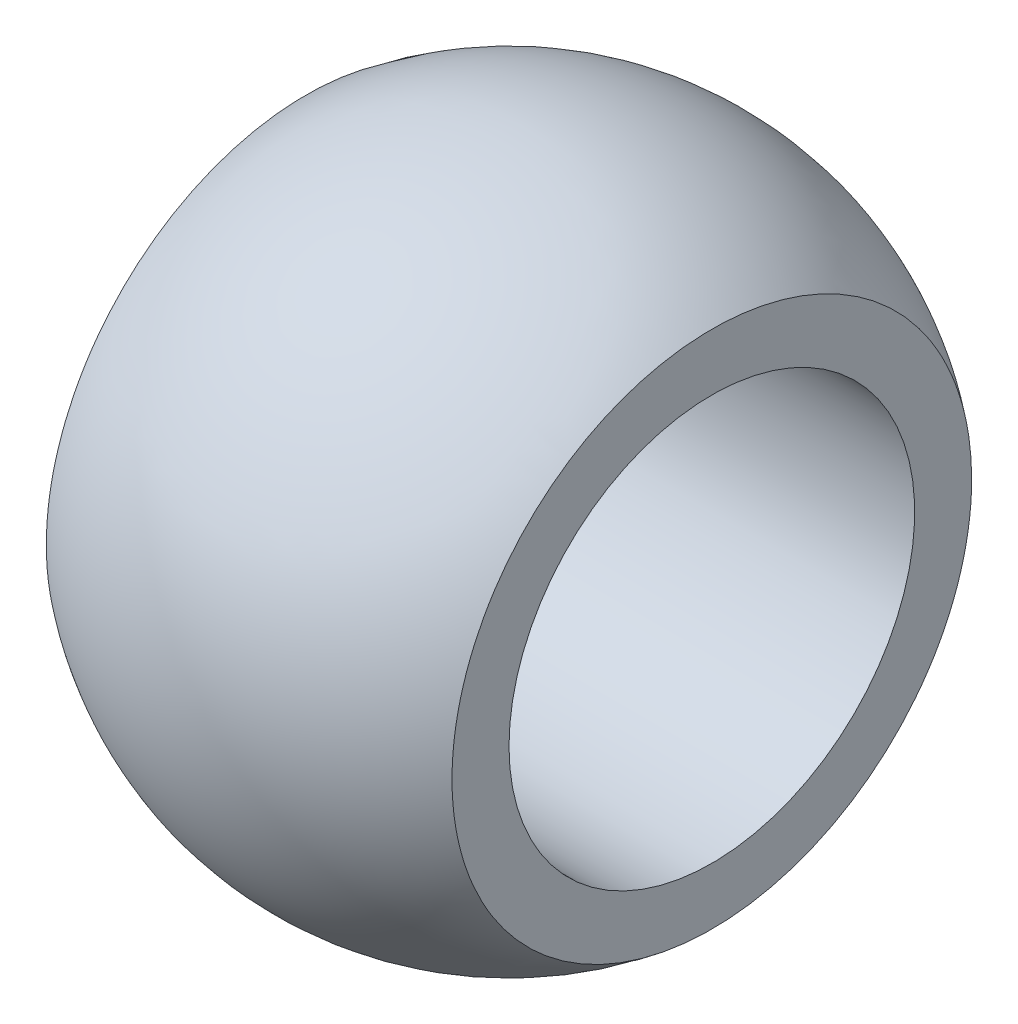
ISO-10303-21;
HEADER;
FILE_DESCRIPTION(('STEP AP214'),'2;1');
FILE_NAME('part.step','',(''),(''),'','','');
FILE_SCHEMA(('AUTOMOTIVE_DESIGN { 1 0 10303 214 1 1 1 1 }'));
ENDSEC;
DATA;
#1=APPLICATION_CONTEXT('core data for automotive mechanical design processes');
#2=APPLICATION_PROTOCOL_DEFINITION('international standard','automotive_design',2000,#1);
#3=PRODUCT_CONTEXT('',#1,'mechanical');
#4=PRODUCT('Part','Part','',(#3));
#5=PRODUCT_RELATED_PRODUCT_CATEGORY('part','',(#4));
#6=PRODUCT_DEFINITION_FORMATION('','',#4);
#7=PRODUCT_DEFINITION_CONTEXT('part definition',#1,'design');
#8=PRODUCT_DEFINITION('design','',#6,#7);
#9=PRODUCT_DEFINITION_SHAPE('','',#8);
#10=(LENGTH_UNIT() NAMED_UNIT(*) SI_UNIT(.MILLI.,.METRE.));
#11=(NAMED_UNIT(*) PLANE_ANGLE_UNIT() SI_UNIT($,.RADIAN.));
#12=(NAMED_UNIT(*) SI_UNIT($,.STERADIAN.) SOLID_ANGLE_UNIT());
#13=UNCERTAINTY_MEASURE_WITH_UNIT(LENGTH_MEASURE(1.E-05),#10,'distance_accuracy_value','');
#14=(GEOMETRIC_REPRESENTATION_CONTEXT(3) GLOBAL_UNCERTAINTY_ASSIGNED_CONTEXT((#13)) GLOBAL_UNIT_ASSIGNED_CONTEXT((#10,
#11,#12)) REPRESENTATION_CONTEXT('',''));
#15=CARTESIAN_POINT('',(0.,0.,0.));
#16=DIRECTION('',(0.,0.,1.));
#17=DIRECTION('',(1.,0.,0.));
#18=AXIS2_PLACEMENT_3D('',#15,#16,#17);
#19=CARTESIAN_POINT('',(-6.5,0.,0.));
#20=DIRECTION('',(-1.,0.,0.));
#21=DIRECTION('',(0.,0.,1.));
#22=AXIS2_PLACEMENT_3D('',#19,#20,#21);
#23=CYLINDRICAL_SURFACE('',#22,4.);
#24=CARTESIAN_POINT('',(-4.,0.,0.));
#25=DIRECTION('',(-1.,0.,0.));
#26=DIRECTION('',(0.,0.,1.));
#27=AXIS2_PLACEMENT_3D('',#24,#25,#26);
#28=CIRCLE('',#27,4.);
#29=CARTESIAN_POINT('',(-4.,0.,4.));
#30=VERTEX_POINT('',#29);
#31=EDGE_CURVE('E47',#30,#30,#28,.T.);
#32=ORIENTED_EDGE('',*,*,#31,.T.);
#33=EDGE_LOOP('',(#32));
#34=FACE_BOUND('',#33,.T.);
#35=CARTESIAN_POINT('',(4.,0.,0.));
#36=DIRECTION('',(-1.,0.,0.));
#37=DIRECTION('',(0.,0.,1.));
#38=AXIS2_PLACEMENT_3D('',#35,#36,#37);
#39=CIRCLE('',#38,4.);
#40=CARTESIAN_POINT('',(4.,0.,4.));
#41=VERTEX_POINT('',#40);
#42=EDGE_CURVE('E19',#41,#41,#39,.F.);
#43=ORIENTED_EDGE('',*,*,#42,.T.);
#44=EDGE_LOOP('',(#43));
#45=FACE_BOUND('',#44,.T.);
#46=ADVANCED_FACE('F16',(#34,#45),#23,.F.);
#47=CARTESIAN_POINT('',(4.,-6.5,-6.5));
#48=DIRECTION('',(-1.,0.,0.));
#49=DIRECTION('',(0.,0.,1.));
#50=AXIS2_PLACEMENT_3D('',#47,#48,#49);
#51=PLANE('',#50);
#52=CARTESIAN_POINT('',(4.,9.74047231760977E-13,-5.1234753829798));
#53=CARTESIAN_POINT('',(4.,-0.143957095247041,-5.12347674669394));
#54=CARTESIAN_POINT('',(4.,-0.287892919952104,-5.11740592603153));
#55=CARTESIAN_POINT('',(4.,-0.574788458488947,-5.09316608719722));
#56=CARTESIAN_POINT('',(4.,-0.717747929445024,-5.07499416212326));
#57=CARTESIAN_POINT('',(4.,-1.00173999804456,-5.02665725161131));
#58=CARTESIAN_POINT('',(4.,-1.14277095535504,-4.99648264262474));
#59=CARTESIAN_POINT('',(4.,-1.42184001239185,-4.92434245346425));
#60=CARTESIAN_POINT('',(4.,-1.55987700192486,-4.88237257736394));
#61=CARTESIAN_POINT('',(4.,-1.83181144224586,-4.78698363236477));
#62=CARTESIAN_POINT('',(4.,-1.96571213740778,-4.73357381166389));
#63=CARTESIAN_POINT('',(4.,-2.22858717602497,-4.61564290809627));
#64=CARTESIAN_POINT('',(4.,-2.35755968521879,-4.5511177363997));
#65=CARTESIAN_POINT('',(4.,-2.60953342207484,-4.41147039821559));
#66=CARTESIAN_POINT('',(4.,-2.73253816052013,-4.33635456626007));
#67=CARTESIAN_POINT('',(4.,-2.97182883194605,-4.17600099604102));
#68=CARTESIAN_POINT('',(4.,-3.08811226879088,-4.09075953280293));
#69=CARTESIAN_POINT('',(4.,-3.31305352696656,-3.91080759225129));
#70=CARTESIAN_POINT('',(4.,-3.4217134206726,-3.81609970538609));
#71=CARTESIAN_POINT('',(4.,-3.6307088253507,-3.61783199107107));
#72=CARTESIAN_POINT('',(4.,-3.73104125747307,-3.51426891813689));
#73=CARTESIAN_POINT('',(4.,-3.92259263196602,-3.29909209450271));
#74=CARTESIAN_POINT('',(4.,-4.01381449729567,-3.1874809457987));
#75=CARTESIAN_POINT('',(4.,-4.18656321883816,-2.9569315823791));
#76=CARTESIAN_POINT('',(4.,-4.2680866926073,-2.83799083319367));
#77=CARTESIAN_POINT('',(4.,-4.42080742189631,-2.59368653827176));
#78=CARTESIAN_POINT('',(4.,-4.49200663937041,-2.46832421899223));
#79=CARTESIAN_POINT('',(4.,-4.62359116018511,-2.21204721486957));
#80=CARTESIAN_POINT('',(4.,-4.68397646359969,-2.08113253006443));
#81=CARTESIAN_POINT('',(4.,-4.79351321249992,-1.81465871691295));
#82=CARTESIAN_POINT('',(4.00000000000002,-4.84266273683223,-1.67909879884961));
#83=CARTESIAN_POINT('',(3.99999999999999,-4.92935008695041,-1.40436765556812));
#84=CARTESIAN_POINT('',(3.99999999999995,-4.96689194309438,-1.26519770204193));
#85=CARTESIAN_POINT('',(3.99999999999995,-5.03013168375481,-0.984139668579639));
#86=CARTESIAN_POINT('',(3.99999999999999,-5.05582530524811,-0.842250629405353));
#87=CARTESIAN_POINT('',(4.00000000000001,-5.09515868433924,-0.556864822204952));
#88=CARTESIAN_POINT('',(4.,-5.10880287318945,-0.41336866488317));
#89=CARTESIAN_POINT('',(4.,-5.12395932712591,-0.125683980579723));
#90=CARTESIAN_POINT('',(4.,-5.12546712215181,0.0185047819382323));
#91=CARTESIAN_POINT('',(4.,-5.11633001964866,0.306443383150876));
#92=CARTESIAN_POINT('',(3.99999999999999,-5.10568960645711,0.450193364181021));
#93=CARTESIAN_POINT('',(3.99999999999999,-5.07233289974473,0.7363385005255));
#94=CARTESIAN_POINT('',(4.,-5.04961221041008,0.87873314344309));
#95=CARTESIAN_POINT('',(4.,-4.99226444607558,1.16104949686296));
#96=CARTESIAN_POINT('',(4.,-4.95764176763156,1.30097210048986));
#97=CARTESIAN_POINT('',(4.,-4.87671885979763,1.57745647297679));
#98=CARTESIAN_POINT('',(4.,-4.83041420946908,1.71401694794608));
#99=CARTESIAN_POINT('',(4.,-4.72648255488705,1.98270108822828));
#100=CARTESIAN_POINT('',(3.99999999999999,-4.66885972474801,2.11482636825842));
#101=CARTESIAN_POINT('',(3.99999999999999,-4.54266834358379,2.37379821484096));
#102=CARTESIAN_POINT('',(4.,-4.47409610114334,2.50064298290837));
#103=CARTESIAN_POINT('',(4.,-4.3265273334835,2.74807373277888));
#104=CARTESIAN_POINT('',(4.,-4.24753322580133,2.86866115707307));
#105=CARTESIAN_POINT('',(4.,-4.07969787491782,3.10270570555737));
#106=CARTESIAN_POINT('',(4.,-3.99086110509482,3.21616603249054));
#107=CARTESIAN_POINT('',(4.,-3.80388990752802,3.43528920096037));
#108=CARTESIAN_POINT('',(3.99999999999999,-3.70574658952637,3.54094441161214));
#109=CARTESIAN_POINT('',(3.99999999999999,-3.39858184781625,3.84478855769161));
#110=CARTESIAN_POINT('',(4.,-3.17660276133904,4.03016616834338));
#111=CARTESIAN_POINT('',(4.,-2.7046460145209,4.36095490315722));
#112=CARTESIAN_POINT('',(4.,-2.45466942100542,4.5063675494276));
#113=CARTESIAN_POINT('',(4.,-2.06413743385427,4.69150567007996));
#114=CARTESIAN_POINT('',(4.,-1.93119804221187,4.74776881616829));
#115=CARTESIAN_POINT('',(4.,-1.66112384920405,4.84885681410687));
#116=CARTESIAN_POINT('',(4.,-1.52399254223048,4.89369091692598));
#117=CARTESIAN_POINT('',(4.,-1.24667135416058,4.97157246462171));
#118=CARTESIAN_POINT('',(4.,-1.10648667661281,5.00463851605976));
#119=CARTESIAN_POINT('',(4.,-0.823857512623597,5.05884851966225));
#120=CARTESIAN_POINT('',(4.,-0.681413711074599,5.07999601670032));
#121=CARTESIAN_POINT('',(4.,-0.44895766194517,5.10455918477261));
#122=CARTESIAN_POINT('',(4.,-0.359317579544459,5.11165052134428));
#123=CARTESIAN_POINT('',(4.,-0.179788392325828,5.12110886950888));
#124=CARTESIAN_POINT('',(4.,-0.089899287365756,5.12347587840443));
#125=CARTESIAN_POINT('',(4.,0.143836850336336,5.12347459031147));
#126=CARTESIAN_POINT('',(4.,0.287699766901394,5.11741315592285));
#127=CARTESIAN_POINT('',(4.,0.574461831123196,5.09320276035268));
#128=CARTESIAN_POINT('',(4.,0.717360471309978,5.07504787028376));
#129=CARTESIAN_POINT('',(4.,1.00137003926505,5.02673244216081));
#130=CARTESIAN_POINT('',(4.,1.14247748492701,4.99655138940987));
#131=CARTESIAN_POINT('',(4.,1.42169473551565,4.92438711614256));
#132=CARTESIAN_POINT('',(4.,1.55980339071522,4.88239945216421));
#133=CARTESIAN_POINT('',(4.,1.83183230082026,4.78697526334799));
#134=CARTESIAN_POINT('',(4.,1.96575735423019,4.73355245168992));
#135=CARTESIAN_POINT('',(4.,2.22865158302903,4.61561508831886));
#136=CARTESIAN_POINT('',(4.,2.35761888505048,4.55109639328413));
#137=CARTESIAN_POINT('',(4.,2.73543475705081,4.34167123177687));
#138=CARTESIAN_POINT('',(4.,2.97563320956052,4.18074226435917));
#139=CARTESIAN_POINT('',(4.,3.42558537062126,3.82078263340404));
#140=CARTESIAN_POINT('',(4.,3.63533608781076,3.62174823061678));
#141=CARTESIAN_POINT('',(4.,3.92259437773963,3.29910509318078));
#142=CARTESIAN_POINT('',(4.,4.01383957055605,3.18745637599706));
#143=CARTESIAN_POINT('',(4.,4.18659130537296,2.95688520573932));
#144=CARTESIAN_POINT('',(4.,4.2681014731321,2.83796548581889));
#145=CARTESIAN_POINT('',(4.,4.42086600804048,2.59359452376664));
#146=CARTESIAN_POINT('',(4.,4.49211242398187,2.46813831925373));
#147=CARTESIAN_POINT('',(4.,4.62375291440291,2.21171201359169));
#148=CARTESIAN_POINT('',(4.,4.68415093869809,2.0807439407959));
#149=CARTESIAN_POINT('',(4.,4.79365026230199,1.81428935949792));
#150=CARTESIAN_POINT('',(4.00000000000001,4.84276068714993,1.67880660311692));
#151=CARTESIAN_POINT('',(3.99999999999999,4.92938738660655,1.40423118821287));
#152=CARTESIAN_POINT('',(3.99999999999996,4.96690644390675,1.2651394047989));
#153=CARTESIAN_POINT('',(3.99999999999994,5.03998527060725,0.940339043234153));
#154=CARTESIAN_POINT('',(3.99999999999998,5.07126513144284,0.75365170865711));
#155=CARTESIAN_POINT('',(4.00000000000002,5.11300930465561,0.37796404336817));
#156=CARTESIAN_POINT('',(4.00000000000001,5.12347360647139,0.188963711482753));
#157=CARTESIAN_POINT('',(4.,5.12347673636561,-0.143956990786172));
#158=CARTESIAN_POINT('',(4.,5.1174059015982,-0.28789272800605));
#159=CARTESIAN_POINT('',(4.,5.09316617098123,-0.57478794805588));
#160=CARTESIAN_POINT('',(4.,5.07499436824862,-0.717747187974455));
#161=CARTESIAN_POINT('',(4.,5.02665724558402,-1.00173956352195));
#162=CARTESIAN_POINT('',(4.,4.99648228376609,-1.14277105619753));
#163=CARTESIAN_POINT('',(4.,4.92434300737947,-1.42183915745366));
#164=CARTESIAN_POINT('',(3.99999999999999,4.88237439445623,-1.55987465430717));
#165=CARTESIAN_POINT('',(3.99999999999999,4.78698114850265,-1.83181569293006));
#166=CARTESIAN_POINT('',(4.,4.73356560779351,-1.96572441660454));
#167=CARTESIAN_POINT('',(4.,4.61564551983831,-2.22858736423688));
#168=CARTESIAN_POINT('',(4.,4.55113683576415,-2.35753971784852));
#169=CARTESIAN_POINT('',(4.,4.34171097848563,-2.73537541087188));
#170=CARTESIAN_POINT('',(3.99999999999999,4.18076446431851,-2.97560545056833));
#171=CARTESIAN_POINT('',(4.,3.82077807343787,-3.42559107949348));
#172=CARTESIAN_POINT('',(4.,3.62173819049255,-3.63534666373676));
#173=CARTESIAN_POINT('',(4.,3.29909115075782,-3.92260596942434));
#174=CARTESIAN_POINT('',(4.,3.18744495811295,-4.01384850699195));
#175=CARTESIAN_POINT('',(4.,2.95687922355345,-4.18659540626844));
#176=CARTESIAN_POINT('',(4.,2.83796241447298,-4.26810339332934));
#177=CARTESIAN_POINT('',(4.,2.59359501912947,-4.42086569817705));
#178=CARTESIAN_POINT('',(4.,2.46813933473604,-4.49211184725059));
#179=CARTESIAN_POINT('',(4.,2.21171410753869,-4.62375189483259));
#180=CARTESIAN_POINT('',(4.,2.08074659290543,-4.68414974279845));
#181=CARTESIAN_POINT('',(4.,1.81429208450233,-4.79364924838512));
#182=CARTESIAN_POINT('',(4.,1.67880880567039,-4.84275994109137));
#183=CARTESIAN_POINT('',(4.,1.40423231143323,-4.92938708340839));
#184=CARTESIAN_POINT('',(4.,1.26513997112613,-4.96690631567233));
#185=CARTESIAN_POINT('',(4.,0.940338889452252,-5.03998530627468));
#186=CARTESIAN_POINT('',(4.,0.753651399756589,-5.07126518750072));
#187=CARTESIAN_POINT('',(4.,0.377963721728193,-5.11300931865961));
#188=CARTESIAN_POINT('',(4.,0.188963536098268,-5.12347359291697));
#189=CARTESIAN_POINT('',(4.,9.74047231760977E-13,-5.1234753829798));
#190=B_SPLINE_CURVE_WITH_KNOTS('',3,(#52,#53,#54,#55,#56,#57,#58,#59,#60,#61,#62,#63,#64,#65,
#66,#67,#68,#69,#70,#71,#72,#73,#74,#75,#76,#77,#78,#79,#80,#81,#82,#83,#84,#85,#86,#87,#88,#89,
#90,#91,#92,#93,#94,#95,#96,#97,#98,#99,#100,#101,#102,#103,#104,#105,#106,#107,#108,#109,#110,
#111,#112,#113,#114,#115,#116,#117,#118,#119,#120,#121,#122,#123,#124,#125,#126,#127,#128,#129,
#130,#131,#132,#133,#134,#135,#136,#137,#138,#139,#140,#141,#142,#143,#144,#145,#146,#147,#148,
#149,#150,#151,#152,#153,#154,#155,#156,#157,#158,#159,#160,#161,#162,#163,#164,#165,#166,#167,
#168,#169,#170,#171,#172,#173,#174,#175,#176,#177,#178,#179,#180,#181,#182,#183,#184,#185,#186,
#187,#188,#189),.UNSPECIFIED.,.T.,.F.,(4,2,2,2,2,2,2,2,2,2,2,2,2,2,2,2,2,2,2,2,2,2,2,2,2,2,2,2,
2,2,2,2,2,2,2,2,2,2,2,2,2,2,2,2,2,2,2,2,2,2,2,2,2,2,2,2,2,2,2,2,2,2,2,2,2,2,2,2,4),(0.,
0.431706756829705,0.863517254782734,1.29567467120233,1.72798968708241,2.15995652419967,
2.59208260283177,3.02395130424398,3.45597937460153,3.88788954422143,4.31995869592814,
4.75188877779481,5.18396906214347,5.61596712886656,6.04796519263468,6.48003706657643,
6.9119587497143,7.34403571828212,7.77595372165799,8.20803080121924,8.63994843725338,
9.07202334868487,9.50393882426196,9.93601800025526,10.3679381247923,10.8000041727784,
11.2319701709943,11.6637406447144,12.0959278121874,12.9591709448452,13.82238119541,
14.2550174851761,14.6873024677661,15.1189008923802,15.5503708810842,15.8200171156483,
16.0896635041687,16.5210916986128,16.9527315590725,17.3851109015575,17.8176531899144,
18.2496796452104,18.6818677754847,19.5448753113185,20.4079675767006,20.8401131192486,
21.2720972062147,21.7044141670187,22.1365734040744,22.5683820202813,23.0000868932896,
23.5667617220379,24.1334368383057,24.565143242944,24.9969533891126,25.4291111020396,
25.8614265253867,26.2933998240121,26.7255345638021,27.5886483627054,28.4517623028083,
28.883896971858,29.3158701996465,29.7481854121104,30.1803429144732,30.6121532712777,
31.0438598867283,31.6105351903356,32.1772098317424),.UNSPECIFIED.);
#191=CARTESIAN_POINT('',(4.,9.74047231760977E-13,-5.1234753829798));
#192=VERTEX_POINT('',#191);
#193=EDGE_CURVE('E25',#192,#192,#190,.T.);
#194=ORIENTED_EDGE('',*,*,#193,.F.);
#195=EDGE_LOOP('',(#194));
#196=FACE_BOUND('',#195,.T.);
#197=ORIENTED_EDGE('',*,*,#42,.F.);
#198=EDGE_LOOP('',(#197));
#199=FACE_BOUND('',#198,.T.);
#200=ADVANCED_FACE('F43',(#196,#199),#51,.F.);
#201=CARTESIAN_POINT('',(-4.,6.5,-6.5));
#202=DIRECTION('',(1.,0.,0.));
#203=DIRECTION('',(0.,0.,-1.));
#204=AXIS2_PLACEMENT_3D('',#201,#202,#203);
#205=PLANE('',#204);
#206=CARTESIAN_POINT('',(-4.,-9.72312508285E-13,5.1234753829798));
#207=CARTESIAN_POINT('',(-4.,-0.14383685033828,5.12347459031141));
#208=CARTESIAN_POINT('',(-4.,-0.287699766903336,5.11741315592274));
#209=CARTESIAN_POINT('',(-4.,-0.574461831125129,5.09320276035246));
#210=CARTESIAN_POINT('',(-4.,-0.717360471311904,5.07504787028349));
#211=CARTESIAN_POINT('',(-4.,-1.00137003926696,5.02673244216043));
#212=CARTESIAN_POINT('',(-4.,-1.14247748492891,4.99655138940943));
#213=CARTESIAN_POINT('',(-4.,-1.42169473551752,4.92438711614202));
#214=CARTESIAN_POINT('',(-4.,-1.55980339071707,4.88239945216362));
#215=CARTESIAN_POINT('',(-4.,-1.83183230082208,4.7869752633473));
#216=CARTESIAN_POINT('',(-4.,-1.96575735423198,4.73355245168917));
#217=CARTESIAN_POINT('',(-4.,-2.22865158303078,4.61561508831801));
#218=CARTESIAN_POINT('',(-4.,-2.35761888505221,4.55109639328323));
#219=CARTESIAN_POINT('',(-4.,-2.73543475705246,4.34167123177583));
#220=CARTESIAN_POINT('',(-4.,-2.9756332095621,4.18074226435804));
#221=CARTESIAN_POINT('',(-4.,-3.42558537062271,3.82078263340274));
#222=CARTESIAN_POINT('',(-4.,-3.63533608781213,3.6217482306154));
#223=CARTESIAN_POINT('',(-4.,-3.92259437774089,3.29910509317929));
#224=CARTESIAN_POINT('',(-4.,-4.01383957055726,3.18745637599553));
#225=CARTESIAN_POINT('',(-4.,-4.18659130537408,2.95688520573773));
#226=CARTESIAN_POINT('',(-4.,-4.26810147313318,2.83796548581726));
#227=CARTESIAN_POINT('',(-4.,-4.42086600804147,2.59359452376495));
#228=CARTESIAN_POINT('',(-4.,-4.49211242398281,2.46813831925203));
#229=CARTESIAN_POINT('',(-4.,-4.62375291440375,2.21171201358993));
#230=CARTESIAN_POINT('',(-4.,-4.68415093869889,2.08074394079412));
#231=CARTESIAN_POINT('',(-4.,-4.79365026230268,1.81428935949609));
#232=CARTESIAN_POINT('',(-4.00000000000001,-4.84276068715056,1.67880660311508));
#233=CARTESIAN_POINT('',(-3.99999999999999,-4.92938738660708,1.40423118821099));
#234=CARTESIAN_POINT('',(-3.99999999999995,-4.96690644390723,1.26513940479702));
#235=CARTESIAN_POINT('',(-3.99999999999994,-5.03998527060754,0.940339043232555));
#236=CARTESIAN_POINT('',(-3.99999999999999,-5.07126513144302,0.753651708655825));
#237=CARTESIAN_POINT('',(-4.00000000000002,-5.11300930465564,0.377964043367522));
#238=CARTESIAN_POINT('',(-4.,-5.12347360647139,0.188963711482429));
#239=CARTESIAN_POINT('',(-4.,-5.12347673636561,-0.143956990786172));
#240=CARTESIAN_POINT('',(-4.,-5.1174059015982,-0.28789272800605));
#241=CARTESIAN_POINT('',(-4.,-5.09316617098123,-0.574787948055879));
#242=CARTESIAN_POINT('',(-4.,-5.07499436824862,-0.717747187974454));
#243=CARTESIAN_POINT('',(-4.,-5.02665724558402,-1.00173956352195));
#244=CARTESIAN_POINT('',(-4.,-4.99648228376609,-1.14277105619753));
#245=CARTESIAN_POINT('',(-4.,-4.92434300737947,-1.42183915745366));
#246=CARTESIAN_POINT('',(-3.99999999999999,-4.88237439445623,-1.55987465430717));
#247=CARTESIAN_POINT('',(-3.99999999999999,-4.78698114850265,-1.83181569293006));
#248=CARTESIAN_POINT('',(-4.,-4.73356560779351,-1.96572441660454));
#249=CARTESIAN_POINT('',(-4.,-4.61564551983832,-2.22858736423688));
#250=CARTESIAN_POINT('',(-4.,-4.55113683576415,-2.35753971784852));
#251=CARTESIAN_POINT('',(-4.,-4.34171097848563,-2.73537541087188));
#252=CARTESIAN_POINT('',(-4.,-4.1807644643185,-2.97560545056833));
#253=CARTESIAN_POINT('',(-4.,-3.82077807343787,-3.42559107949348));
#254=CARTESIAN_POINT('',(-4.,-3.62173819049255,-3.63534666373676));
#255=CARTESIAN_POINT('',(-4.,-3.29909115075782,-3.92260596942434));
#256=CARTESIAN_POINT('',(-4.,-3.18744495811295,-4.01384850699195));
#257=CARTESIAN_POINT('',(-4.,-2.95687922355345,-4.18659540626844));
#258=CARTESIAN_POINT('',(-4.,-2.83796241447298,-4.26810339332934));
#259=CARTESIAN_POINT('',(-4.,-2.59359501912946,-4.42086569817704));
#260=CARTESIAN_POINT('',(-4.,-2.46813933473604,-4.49211184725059));
#261=CARTESIAN_POINT('',(-4.,-2.21171410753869,-4.6237518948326));
#262=CARTESIAN_POINT('',(-4.,-2.08074659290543,-4.68414974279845));
#263=CARTESIAN_POINT('',(-4.,-1.81429208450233,-4.79364924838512));
#264=CARTESIAN_POINT('',(-4.,-1.67880880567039,-4.84275994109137));
#265=CARTESIAN_POINT('',(-4.,-1.40423231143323,-4.92938708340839));
#266=CARTESIAN_POINT('',(-4.,-1.26513997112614,-4.96690631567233));
#267=CARTESIAN_POINT('',(-4.,-0.940338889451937,-5.03998530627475));
#268=CARTESIAN_POINT('',(-4.,-0.753651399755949,-5.07126518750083));
#269=CARTESIAN_POINT('',(-4.,-0.3779637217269,-5.11300931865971));
#270=CARTESIAN_POINT('',(-4.,-0.188963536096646,-5.12347359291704));
#271=CARTESIAN_POINT('',(-4.,0.143957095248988,-5.12347674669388));
#272=CARTESIAN_POINT('',(-4.,0.287892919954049,-5.11740592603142));
#273=CARTESIAN_POINT('',(-4.,0.574788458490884,-5.093166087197));
#274=CARTESIAN_POINT('',(-4.,0.717747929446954,-5.07499416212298));
#275=CARTESIAN_POINT('',(-4.,1.00173999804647,-5.02665725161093));
#276=CARTESIAN_POINT('',(-4.,1.14277095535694,-4.9964826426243));
#277=CARTESIAN_POINT('',(-4.,1.42184001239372,-4.92434245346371));
#278=CARTESIAN_POINT('',(-4.,1.55987700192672,-4.88237257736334));
#279=CARTESIAN_POINT('',(-4.,1.83181144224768,-4.78698363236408));
#280=CARTESIAN_POINT('',(-4.,1.96571213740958,-4.73357381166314));
#281=CARTESIAN_POINT('',(-4.,2.22858717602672,-4.61564290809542));
#282=CARTESIAN_POINT('',(-4.,2.35755968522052,-4.5511177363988));
#283=CARTESIAN_POINT('',(-4.,2.60953342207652,-4.4114703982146));
#284=CARTESIAN_POINT('',(-4.,2.73253816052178,-4.33635456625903));
#285=CARTESIAN_POINT('',(-4.,2.97182883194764,-4.1760009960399));
#286=CARTESIAN_POINT('',(-4.,3.08811226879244,-4.09075953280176));
#287=CARTESIAN_POINT('',(-4.,3.31305352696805,-3.91080759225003));
#288=CARTESIAN_POINT('',(-4.,3.42171342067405,-3.81609970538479));
#289=CARTESIAN_POINT('',(-4.,3.63070882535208,-3.61783199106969));
#290=CARTESIAN_POINT('',(-4.,3.73104125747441,-3.51426891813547));
#291=CARTESIAN_POINT('',(-4.,3.92259263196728,-3.29909209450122));
#292=CARTESIAN_POINT('',(-4.,4.01381449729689,-3.18748094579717));
#293=CARTESIAN_POINT('',(-4.,4.18656321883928,-2.95693158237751));
#294=CARTESIAN_POINT('',(-4.,4.26808669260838,-2.83799083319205));
#295=CARTESIAN_POINT('',(-4.,4.4208074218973,-2.59368653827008));
#296=CARTESIAN_POINT('',(-4.,4.49200663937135,-2.46832421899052));
#297=CARTESIAN_POINT('',(-4.,4.62359116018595,-2.21204721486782));
#298=CARTESIAN_POINT('',(-4.,4.68397646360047,-2.08113253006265));
#299=CARTESIAN_POINT('',(-4.,4.79351321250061,-1.81465871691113));
#300=CARTESIAN_POINT('',(-4.00000000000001,4.84266273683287,-1.67909879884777));
#301=CARTESIAN_POINT('',(-3.99999999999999,4.92935008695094,-1.40436765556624));
#302=CARTESIAN_POINT('',(-3.99999999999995,4.96689194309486,-1.26519770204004));
#303=CARTESIAN_POINT('',(-3.99999999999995,5.03013168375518,-0.984139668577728));
#304=CARTESIAN_POINT('',(-3.99999999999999,5.05582530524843,-0.842250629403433));
#305=CARTESIAN_POINT('',(-4.00000000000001,5.09515868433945,-0.556864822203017));
#306=CARTESIAN_POINT('',(-4.,5.1088028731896,-0.413368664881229));
#307=CARTESIAN_POINT('',(-4.,5.12395932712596,-0.125683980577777));
#308=CARTESIAN_POINT('',(-4.,5.12546712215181,0.0185047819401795));
#309=CARTESIAN_POINT('',(-4.,5.11633001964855,0.30644338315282));
#310=CARTESIAN_POINT('',(-3.99999999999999,5.10568960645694,0.450193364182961));
#311=CARTESIAN_POINT('',(-3.99999999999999,5.07233289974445,0.736338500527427));
#312=CARTESIAN_POINT('',(-4.,5.04961221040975,0.878733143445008));
#313=CARTESIAN_POINT('',(-4.,4.99226444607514,1.16104949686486));
#314=CARTESIAN_POINT('',(-4.,4.95764176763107,1.30097210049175));
#315=CARTESIAN_POINT('',(-4.,4.87671885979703,1.57745647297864));
#316=CARTESIAN_POINT('',(-4.,4.83041420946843,1.71401694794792));
#317=CARTESIAN_POINT('',(-4.,4.72648255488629,1.98270108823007));
#318=CARTESIAN_POINT('',(-3.99999999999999,4.6688597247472,2.1148263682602));
#319=CARTESIAN_POINT('',(-3.99999999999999,4.54266834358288,2.37379821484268));
#320=CARTESIAN_POINT('',(-4.,4.47409610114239,2.50064298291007));
#321=CARTESIAN_POINT('',(-4.,4.32652733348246,2.74807373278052));
#322=CARTESIAN_POINT('',(-4.,4.24753322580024,2.86866115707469));
#323=CARTESIAN_POINT('',(-4.,4.07969787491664,3.10270570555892));
#324=CARTESIAN_POINT('',(-4.,3.99086110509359,3.21616603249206));
#325=CARTESIAN_POINT('',(-4.,3.80388990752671,3.43528920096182));
#326=CARTESIAN_POINT('',(-3.99999999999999,3.70574658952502,3.54094441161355));
#327=CARTESIAN_POINT('',(-3.99999999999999,3.39858184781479,3.8447885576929));
#328=CARTESIAN_POINT('',(-4.,3.17660276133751,4.03016616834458));
#329=CARTESIAN_POINT('',(-4.,2.70464601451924,4.36095490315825));
#330=CARTESIAN_POINT('',(-4.,2.45466942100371,4.50636754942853));
#331=CARTESIAN_POINT('',(-4.,2.06413743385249,4.69150567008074));
#332=CARTESIAN_POINT('',(-4.,1.93119804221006,4.74776881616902));
#333=CARTESIAN_POINT('',(-4.,1.66112384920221,4.8488568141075));
#334=CARTESIAN_POINT('',(-4.,1.52399254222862,4.89369091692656));
#335=CARTESIAN_POINT('',(-4.,1.24667135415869,4.97157246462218));
#336=CARTESIAN_POINT('',(-4.,1.10648667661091,5.00463851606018));
#337=CARTESIAN_POINT('',(-4.,0.823857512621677,5.05884851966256));
#338=CARTESIAN_POINT('',(-4.,0.681413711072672,5.07999601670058));
#339=CARTESIAN_POINT('',(-4.,0.448957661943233,5.10455918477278));
#340=CARTESIAN_POINT('',(-4.,0.35931757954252,5.11165052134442));
#341=CARTESIAN_POINT('',(-4.,0.179788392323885,5.12110886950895));
#342=CARTESIAN_POINT('',(-4.,0.0898992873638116,5.12347587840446));
#343=CARTESIAN_POINT('',(-4.,-9.72312508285E-13,5.1234753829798));
#344=B_SPLINE_CURVE_WITH_KNOTS('',3,(#206,#207,#208,#209,#210,#211,#212,#213,#214,#215,#216,
#217,#218,#219,#220,#221,#222,#223,#224,#225,#226,#227,#228,#229,#230,#231,#232,#233,#234,#235,
#236,#237,#238,#239,#240,#241,#242,#243,#244,#245,#246,#247,#248,#249,#250,#251,#252,#253,#254,
#255,#256,#257,#258,#259,#260,#261,#262,#263,#264,#265,#266,#267,#268,#269,#270,#271,#272,#273,
#274,#275,#276,#277,#278,#279,#280,#281,#282,#283,#284,#285,#286,#287,#288,#289,#290,#291,#292,
#293,#294,#295,#296,#297,#298,#299,#300,#301,#302,#303,#304,#305,#306,#307,#308,#309,#310,#311,
#312,#313,#314,#315,#316,#317,#318,#319,#320,#321,#322,#323,#324,#325,#326,#327,#328,#329,#330,
#331,#332,#333,#334,#335,#336,#337,#338,#339,#340,#341,#342,#343),.UNSPECIFIED.,.T.,.F.,(4,2,2,
2,2,2,2,2,2,2,2,2,2,2,2,2,2,2,2,2,2,2,2,2,2,2,2,2,2,2,2,2,2,2,2,2,2,2,2,2,2,2,2,2,2,2,2,2,2,2,2,
2,2,2,2,2,2,2,2,2,2,2,2,2,2,2,2,2,4),(0.,0.431428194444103,0.863068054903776,1.29544739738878,
1.72798968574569,2.16001614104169,2.59220427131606,3.45521180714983,4.31830407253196,
4.7504496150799,5.18243370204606,5.61475066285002,6.04690989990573,6.47871851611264,
6.91042338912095,7.47709821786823,8.0437733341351,8.47547973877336,8.90728988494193,
9.33944759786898,9.77176302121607,10.2037363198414,10.6358710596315,11.4989848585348,
12.3620987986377,12.7942334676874,13.2262066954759,13.6585219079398,14.0906794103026,
14.5224897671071,14.9541963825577,15.520871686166,16.0875463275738,16.5192530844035,
16.9510635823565,17.3832209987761,17.8155360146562,18.2475028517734,18.6796289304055,
19.1114976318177,19.5435257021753,19.9754358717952,20.4075050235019,20.8394351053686,
21.2715153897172,21.7035134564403,22.1355115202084,22.5675833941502,22.999505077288,
23.4315820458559,23.8635000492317,24.295577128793,24.7274947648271,25.1595696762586,
25.5914851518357,26.023564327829,26.4554844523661,26.8875505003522,27.319516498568,
27.7512869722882,28.1834741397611,29.046717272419,29.9099275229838,30.3425638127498,
30.7748487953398,31.206447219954,31.6379172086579,31.9075634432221,32.1772098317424),.UNSPECIFIED.);
#345=CARTESIAN_POINT('',(-4.,-9.72312508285E-13,5.1234753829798));
#346=VERTEX_POINT('',#345);
#347=EDGE_CURVE('E11',#346,#346,#344,.T.);
#348=ORIENTED_EDGE('',*,*,#347,.F.);
#349=EDGE_LOOP('',(#348));
#350=FACE_BOUND('',#349,.T.);
#351=ORIENTED_EDGE('',*,*,#31,.F.);
#352=EDGE_LOOP('',(#351));
#353=FACE_BOUND('',#352,.T.);
#354=ADVANCED_FACE('F34',(#350,#353),#205,.F.);
#355=CARTESIAN_POINT('',(0.,0.,0.));
#356=DIRECTION('',(0.,0.,-1.));
#357=DIRECTION('',(0.,-1.,0.));
#358=AXIS2_PLACEMENT_3D('',#355,#356,#357);
#359=SPHERICAL_SURFACE('',#358,6.5);
#360=CARTESIAN_POINT('',(0.,0.,-6.5));
#361=VERTEX_POINT('',#360);
#362=VERTEX_LOOP('',#361);
#363=FACE_BOUND('',#362,.T.);
#364=ORIENTED_EDGE('',*,*,#193,.T.);
#365=EDGE_LOOP('',(#364));
#366=FACE_BOUND('',#365,.T.);
#367=CARTESIAN_POINT('',(0.,0.,6.5));
#368=VERTEX_POINT('',#367);
#369=VERTEX_LOOP('',#368);
#370=FACE_BOUND('',#369,.T.);
#371=ORIENTED_EDGE('',*,*,#347,.T.);
#372=EDGE_LOOP('',(#371));
#373=FACE_BOUND('',#372,.T.);
#374=ADVANCED_FACE('F31',(#363,#366,#370,#373),#359,.T.);
#375=CLOSED_SHELL('',(#46,#200,#354,#374));
#376=MANIFOLD_SOLID_BREP('B1',#375);
#377=ADVANCED_BREP_SHAPE_REPRESENTATION('',(#18,#376),#14);
#378=SHAPE_DEFINITION_REPRESENTATION(#9,#377);
ENDSEC;
END-ISO-10303-21;
